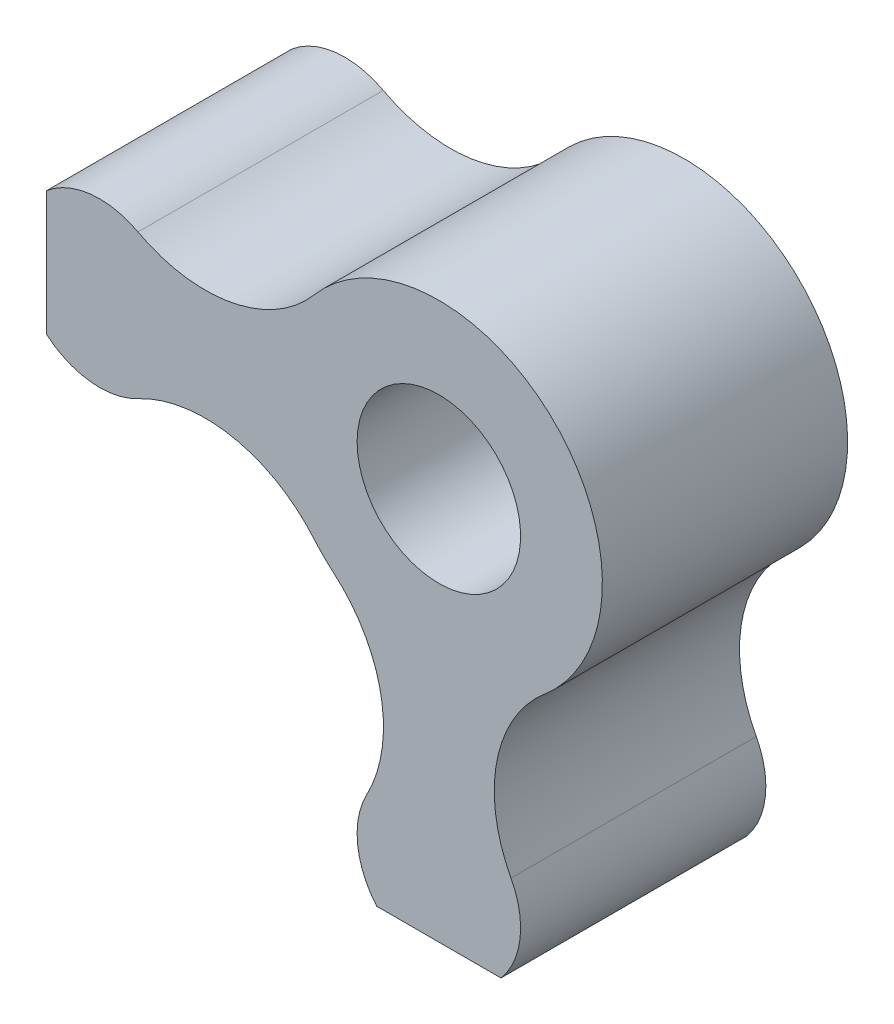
from build123d import *

# Parameters (mm, degrees)
ESQUISSE1_R          = 2
BASE_EXTRUSION_DEPTH = 3


with BuildPart() as part:
    # Esquisse1 → Base-Extrusion (new, symmetric)
    with BuildSketch(Plane.XY):
        with BuildLine():
            Line((-1.519868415, -9.6), (1.519868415, -9.6))
            ThreePointArc((1.519868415, -9.6), (1.988070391, -8.51811951), (1.765577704, -7.360460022))
            ThreePointArc((1.765577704, -7.360460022), (1.417541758, -5.059338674), (2.589513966, -3.048674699))
            ThreePointArc((2.589513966, -3.048674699), (2.828427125, 2.828427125), (-3.048674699, 2.589513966))
            ThreePointArc((-3.048674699, 2.589513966), (-5.059338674, 1.417541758), (-7.360460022, 1.765577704))
            ThreePointArc((-7.360460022, 1.765577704), (-8.51811951, 1.988070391), (-9.6, 1.519868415))
            Line((-9.6, 1.519868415), (-9.6, -1.519868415))
            ThreePointArc((-9.6, -1.519868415), (-8.51811951, -1.988070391), (-7.360460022, -1.765577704))
            ThreePointArc((-7.360460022, -1.765577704), (-5.059338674, -1.417541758), (-3.048674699, -2.589513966))
            ThreePointArc((-3.048674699, -2.589513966), (-2.828427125, -2.828427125), (-2.589513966, -3.048674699))
            ThreePointArc((-2.589513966, -3.048674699), (-1.417541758, -5.059338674), (-1.765577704, -7.360460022))
            ThreePointArc((-1.765577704, -7.360460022), (-1.988070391, -8.51811951), (-1.519868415, -9.6))
        make_face()
        with Locations(Location((0, 0, 0), (0, 0, 180))):
            Circle(ESQUISSE1_R, mode=Mode.SUBTRACT)
    extrude(amount=BASE_EXTRUSION_DEPTH, both=True)


solid = part.part
